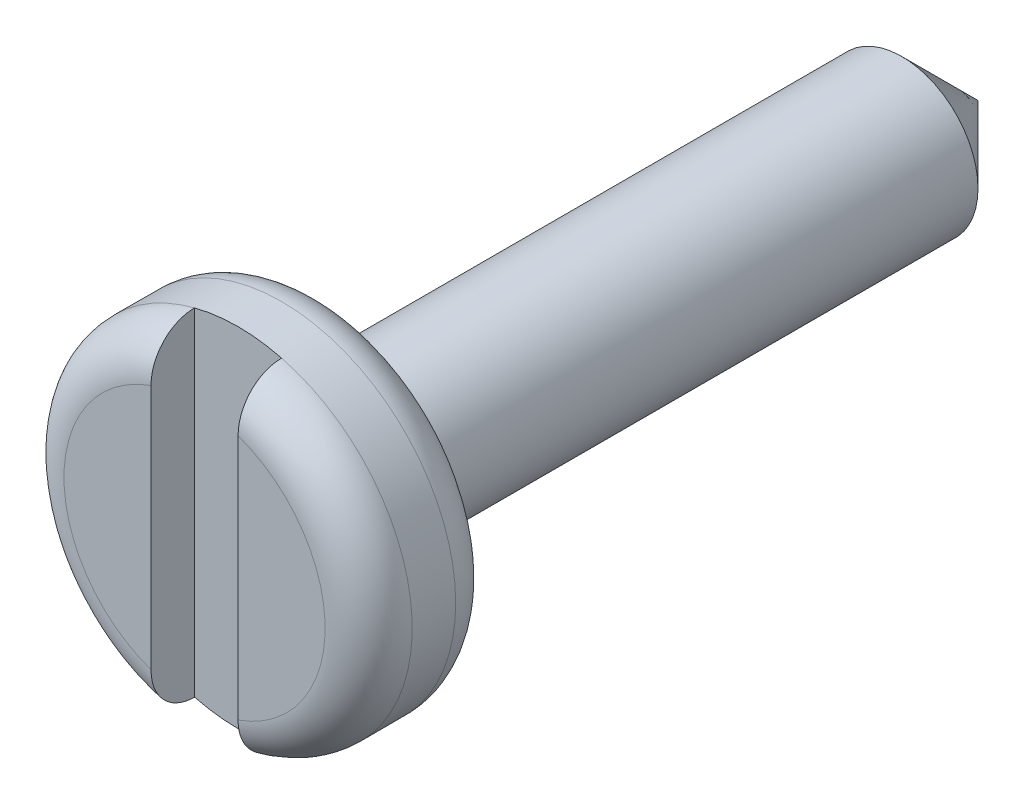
from build123d import *

# Parameters (mm, degrees)
SKETCH1_R           = 1.75
BASE_EXTRUDE_DEPTH  = 15
SKETCH2_R           = 4
BOSS_EXTRUDE1_DEPTH = 3
FILLET3_R           = 1
SKETCH5_W           = 2
SKETCH5_H           = 10
CUT_EXTRUDE2_DEPTH  = 1
CHAMFER1_SIZE       = 1.75


with BuildPart() as part:
    # Sketch1 → Base-Extrude (new body)
    with BuildSketch(Plane.XY):
        Circle(SKETCH1_R)
    extrude(amount=-BASE_EXTRUDE_DEPTH)

    # Sketch2 → Boss-Extrude1 (add)
    with BuildSketch(Plane(origin=(0, 0, 0), x_dir=(-1, 0, 0), z_dir=(0, 0, -1))):
        Circle(SKETCH2_R)
    extrude(amount=-BOSS_EXTRUDE1_DEPTH)

    # Fillet3
    fillet3_edges = [part.edges().sort_by_distance(p)[0] for p in [
        (4, 0, 3),
        (4, 0, 0),
    ]]
    fillet(fillet3_edges, radius=FILLET3_R)

    # Sketch5 → Cut-Extrude2 (cut)
    with BuildSketch(Plane.XY.offset(3)):
        with Locations((0, -0.000581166)):
            Rectangle(SKETCH5_W, SKETCH5_H)
    extrude(amount=-CUT_EXTRUDE2_DEPTH, mode=Mode.SUBTRACT)

    # Chamfer1
    chamfer1_edges = [part.edges().sort_by_distance(p)[0] for p in [
        (-1.75, 0, -15),
    ]]
    chamfer(chamfer1_edges, length=CHAMFER1_SIZE)


solid = part.part
